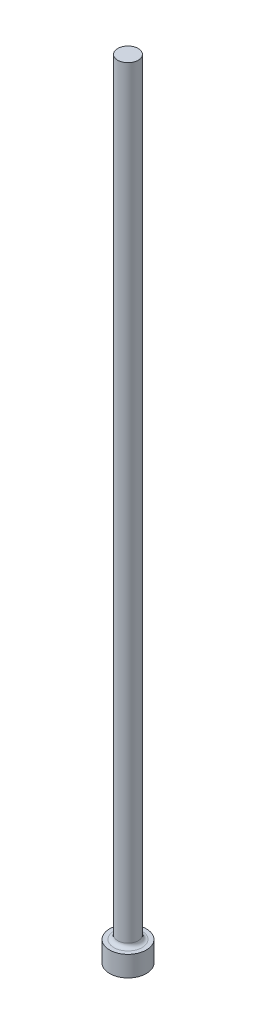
ISO-10303-21;
HEADER;
FILE_DESCRIPTION(('STEP AP214'),'2;1');
FILE_NAME('part.step','',(''),(''),'','','');
FILE_SCHEMA(('AUTOMOTIVE_DESIGN { 1 0 10303 214 1 1 1 1 }'));
ENDSEC;
DATA;
#1=APPLICATION_CONTEXT('core data for automotive mechanical design processes');
#2=APPLICATION_PROTOCOL_DEFINITION('international standard','automotive_design',2000,#1);
#3=PRODUCT_CONTEXT('',#1,'mechanical');
#4=PRODUCT('Part','Part','',(#3));
#5=PRODUCT_RELATED_PRODUCT_CATEGORY('part','',(#4));
#6=PRODUCT_DEFINITION_FORMATION('','',#4);
#7=PRODUCT_DEFINITION_CONTEXT('part definition',#1,'design');
#8=PRODUCT_DEFINITION('design','',#6,#7);
#9=PRODUCT_DEFINITION_SHAPE('','',#8);
#10=(LENGTH_UNIT() NAMED_UNIT(*) SI_UNIT(.MILLI.,.METRE.));
#11=(NAMED_UNIT(*) PLANE_ANGLE_UNIT() SI_UNIT($,.RADIAN.));
#12=(NAMED_UNIT(*) SI_UNIT($,.STERADIAN.) SOLID_ANGLE_UNIT());
#13=UNCERTAINTY_MEASURE_WITH_UNIT(LENGTH_MEASURE(1.E-05),#10,'distance_accuracy_value','');
#14=(GEOMETRIC_REPRESENTATION_CONTEXT(3) GLOBAL_UNCERTAINTY_ASSIGNED_CONTEXT((#13)) GLOBAL_UNIT_ASSIGNED_CONTEXT((#10,
#11,#12)) REPRESENTATION_CONTEXT('',''));
#15=CARTESIAN_POINT('',(0.,0.,0.));
#16=DIRECTION('',(0.,0.,1.));
#17=DIRECTION('',(1.,0.,0.));
#18=AXIS2_PLACEMENT_3D('',#15,#16,#17);
#19=CARTESIAN_POINT('',(1.98374000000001,152.4,0.));
#20=DIRECTION('',(0.,-1.,0.));
#21=DIRECTION('',(1.,0.,0.));
#22=AXIS2_PLACEMENT_3D('',#19,#20,#21);
#23=PLANE('',#22);
#24=CARTESIAN_POINT('',(0.,152.4,0.));
#25=DIRECTION('',(0.,1.,0.));
#26=DIRECTION('',(-1.,0.,0.));
#27=AXIS2_PLACEMENT_3D('',#24,#25,#26);
#28=CIRCLE('',#27,1.98374);
#29=CARTESIAN_POINT('',(-1.98373999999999,152.4,0.));
#30=VERTEX_POINT('',#29);
#31=EDGE_CURVE('E10',#30,#30,#28,.T.);
#32=ORIENTED_EDGE('',*,*,#31,.T.);
#33=EDGE_LOOP('',(#32));
#34=FACE_BOUND('',#33,.T.);
#35=ADVANCED_FACE('F30',(#34),#23,.F.);
#36=CARTESIAN_POINT('',(0.,152.4,0.));
#37=DIRECTION('',(0.,1.,0.));
#38=DIRECTION('',(-1.,0.,0.));
#39=AXIS2_PLACEMENT_3D('',#36,#37,#38);
#40=CYLINDRICAL_SURFACE('',#39,1.98374);
#41=ORIENTED_EDGE('',*,*,#31,.F.);
#42=EDGE_LOOP('',(#41));
#43=FACE_BOUND('',#42,.T.);
#44=CARTESIAN_POINT('',(0.,4.72440000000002,0.));
#45=DIRECTION('',(0.,1.,0.));
#46=DIRECTION('',(-1.,0.,0.));
#47=AXIS2_PLACEMENT_3D('',#44,#45,#46);
#48=CIRCLE('',#47,1.98374);
#49=CARTESIAN_POINT('',(-1.98374,4.72440000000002,0.));
#50=VERTEX_POINT('',#49);
#51=EDGE_CURVE('E36',#50,#50,#48,.T.);
#52=ORIENTED_EDGE('',*,*,#51,.T.);
#53=EDGE_LOOP('',(#52));
#54=FACE_BOUND('',#53,.T.);
#55=ADVANCED_FACE('F65',(#43,#54),#40,.T.);
#56=CARTESIAN_POINT('',(0.,4.7244,0.));
#57=DIRECTION('',(0.,1.,0.));
#58=DIRECTION('',(-1.,0.,0.));
#59=AXIS2_PLACEMENT_3D('',#56,#57,#58);
#60=TOROIDAL_SURFACE('',#59,2.74574,0.762);
#61=ORIENTED_EDGE('',*,*,#51,.F.);
#62=EDGE_LOOP('',(#61));
#63=FACE_BOUND('',#62,.T.);
#64=CARTESIAN_POINT('',(0.,3.96240000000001,0.));
#65=DIRECTION('',(0.,1.,0.));
#66=DIRECTION('',(-1.,0.,0.));
#67=AXIS2_PLACEMENT_3D('',#64,#65,#66);
#68=CIRCLE('',#67,2.74574);
#69=CARTESIAN_POINT('',(-2.74574,3.96240000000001,0.));
#70=VERTEX_POINT('',#69);
#71=EDGE_CURVE('E40',#70,#70,#68,.T.);
#72=ORIENTED_EDGE('',*,*,#71,.T.);
#73=EDGE_LOOP('',(#72));
#74=FACE_BOUND('',#73,.T.);
#75=ADVANCED_FACE('F69',(#63,#74),#60,.F.);
#76=CARTESIAN_POINT('',(3.556,3.9624,0.));
#77=DIRECTION('',(0.,-1.,0.));
#78=DIRECTION('',(1.,0.,0.));
#79=AXIS2_PLACEMENT_3D('',#76,#77,#78);
#80=PLANE('',#79);
#81=ORIENTED_EDGE('',*,*,#71,.F.);
#82=EDGE_LOOP('',(#81));
#83=FACE_BOUND('',#82,.T.);
#84=CARTESIAN_POINT('',(0.,3.96240000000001,0.));
#85=DIRECTION('',(0.,1.,0.));
#86=DIRECTION('',(-1.,0.,0.));
#87=AXIS2_PLACEMENT_3D('',#84,#85,#86);
#88=CIRCLE('',#87,3.556);
#89=CARTESIAN_POINT('',(-3.556,3.96240000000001,0.));
#90=VERTEX_POINT('',#89);
#91=EDGE_CURVE('E44',#90,#90,#88,.T.);
#92=ORIENTED_EDGE('',*,*,#91,.T.);
#93=EDGE_LOOP('',(#92));
#94=FACE_BOUND('',#93,.T.);
#95=ADVANCED_FACE('F61',(#83,#94),#80,.F.);
#96=CARTESIAN_POINT('',(0.,152.4,0.));
#97=DIRECTION('',(0.,1.,0.));
#98=DIRECTION('',(-1.,0.,0.));
#99=AXIS2_PLACEMENT_3D('',#96,#97,#98);
#100=CYLINDRICAL_SURFACE('',#99,3.556);
#101=ORIENTED_EDGE('',*,*,#91,.F.);
#102=EDGE_LOOP('',(#101));
#103=FACE_BOUND('',#102,.T.);
#104=CARTESIAN_POINT('',(0.,0.,0.));
#105=DIRECTION('',(0.,1.,0.));
#106=DIRECTION('',(-1.,0.,0.));
#107=AXIS2_PLACEMENT_3D('',#104,#105,#106);
#108=CIRCLE('',#107,3.556);
#109=CARTESIAN_POINT('',(-3.556,0.,0.));
#110=VERTEX_POINT('',#109);
#111=EDGE_CURVE('E49',#110,#110,#108,.T.);
#112=ORIENTED_EDGE('',*,*,#111,.T.);
#113=EDGE_LOOP('',(#112));
#114=FACE_BOUND('',#113,.T.);
#115=ADVANCED_FACE('F53',(#103,#114),#100,.T.);
#116=CARTESIAN_POINT('',(0.,0.,0.));
#117=DIRECTION('',(0.,1.,0.));
#118=DIRECTION('',(-1.,0.,0.));
#119=AXIS2_PLACEMENT_3D('',#116,#117,#118);
#120=PLANE('',#119);
#121=ORIENTED_EDGE('',*,*,#111,.F.);
#122=EDGE_LOOP('',(#121));
#123=FACE_BOUND('',#122,.T.);
#124=ADVANCED_FACE('F55',(#123),#120,.F.);
#125=CLOSED_SHELL('',(#35,#55,#75,#95,#115,#124));
#126=MANIFOLD_SOLID_BREP('B2',#125);
#127=ADVANCED_BREP_SHAPE_REPRESENTATION('',(#18,#126),#14);
#128=SHAPE_DEFINITION_REPRESENTATION(#9,#127);
ENDSEC;
END-ISO-10303-21;
